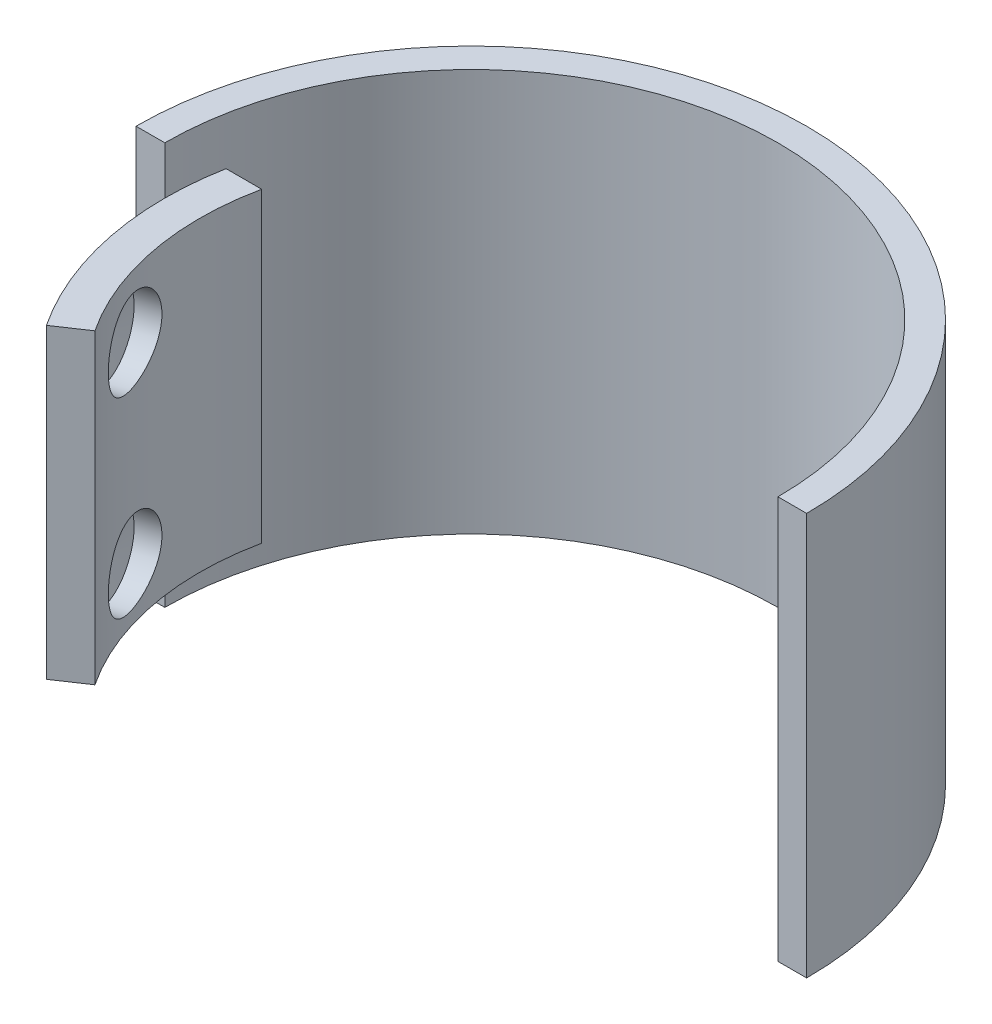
ISO-10303-21;
HEADER;
FILE_DESCRIPTION(('STEP AP214'),'2;1');
FILE_NAME('part.step','',(''),(''),'','','');
FILE_SCHEMA(('AUTOMOTIVE_DESIGN { 1 0 10303 214 1 1 1 1 }'));
ENDSEC;
DATA;
#1=APPLICATION_CONTEXT('core data for automotive mechanical design processes');
#2=APPLICATION_PROTOCOL_DEFINITION('international standard','automotive_design',2000,#1);
#3=PRODUCT_CONTEXT('',#1,'mechanical');
#4=PRODUCT('Part','Part','',(#3));
#5=PRODUCT_RELATED_PRODUCT_CATEGORY('part','',(#4));
#6=PRODUCT_DEFINITION_FORMATION('','',#4);
#7=PRODUCT_DEFINITION_CONTEXT('part definition',#1,'design');
#8=PRODUCT_DEFINITION('design','',#6,#7);
#9=PRODUCT_DEFINITION_SHAPE('','',#8);
#10=(LENGTH_UNIT() NAMED_UNIT(*) SI_UNIT(.MILLI.,.METRE.));
#11=(NAMED_UNIT(*) PLANE_ANGLE_UNIT() SI_UNIT($,.RADIAN.));
#12=(NAMED_UNIT(*) SI_UNIT($,.STERADIAN.) SOLID_ANGLE_UNIT());
#13=UNCERTAINTY_MEASURE_WITH_UNIT(LENGTH_MEASURE(1.E-05),#10,'distance_accuracy_value','');
#14=(GEOMETRIC_REPRESENTATION_CONTEXT(3) GLOBAL_UNCERTAINTY_ASSIGNED_CONTEXT((#13)) GLOBAL_UNIT_ASSIGNED_CONTEXT((#10,
#11,#12)) REPRESENTATION_CONTEXT('',''));
#15=CARTESIAN_POINT('',(0.,0.,0.));
#16=DIRECTION('',(0.,0.,1.));
#17=DIRECTION('',(1.,0.,0.));
#18=AXIS2_PLACEMENT_3D('',#15,#16,#17);
#19=CARTESIAN_POINT('',(0.,42.,0.));
#20=DIRECTION('',(0.,-1.,0.));
#21=DIRECTION('',(0.,0.,-1.));
#22=AXIS2_PLACEMENT_3D('',#19,#20,#21);
#23=CYLINDRICAL_SURFACE('',#22,28.3557302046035);
#24=CARTESIAN_POINT('',(-27.0775799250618,26.3940727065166,8.41736899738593));
#25=CARTESIAN_POINT('',(-27.007134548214,26.3940824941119,8.64396979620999));
#26=CARTESIAN_POINT('',(-26.9337812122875,26.4140140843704,8.86981087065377));
#27=CARTESIAN_POINT('',(-26.7836104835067,26.4931937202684,9.31346637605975));
#28=CARTESIAN_POINT('',(-26.7067897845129,26.552480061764,9.53127277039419));
#29=CARTESIAN_POINT('',(-26.5526498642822,26.7085580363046,9.95261365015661));
#30=CARTESIAN_POINT('',(-26.4753310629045,26.8053213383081,10.1561587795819));
#31=CARTESIAN_POINT('',(-26.3233539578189,27.0335372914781,10.5438074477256));
#32=CARTESIAN_POINT('',(-26.2486952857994,27.1649851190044,10.727913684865));
#33=CARTESIAN_POINT('',(-26.1048669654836,27.4599313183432,11.0733308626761));
#34=CARTESIAN_POINT('',(-26.0357392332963,27.6236468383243,11.234473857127));
#35=CARTESIAN_POINT('',(-25.9069147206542,27.978013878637,11.5284442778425));
#36=CARTESIAN_POINT('',(-25.8472184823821,28.1686669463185,11.6612700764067));
#37=CARTESIAN_POINT('',(-25.740084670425,28.5726580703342,11.8958922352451));
#38=CARTESIAN_POINT('',(-25.6927088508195,28.7861031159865,11.9975327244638));
#39=CARTESIAN_POINT('',(-25.6132266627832,29.22889122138,12.1662981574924));
#40=CARTESIAN_POINT('',(-25.5811194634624,29.4582334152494,12.2334249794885));
#41=CARTESIAN_POINT('',(-25.5342069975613,29.9244882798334,12.3310441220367));
#42=CARTESIAN_POINT('',(-25.5192741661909,30.1613315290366,12.3618065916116));
#43=CARTESIAN_POINT('',(-25.5071570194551,30.6373808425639,12.3867905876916));
#44=CARTESIAN_POINT('',(-25.5099716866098,30.8765867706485,12.3810142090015));
#45=CARTESIAN_POINT('',(-25.5330829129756,31.3484815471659,12.3332796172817));
#46=CARTESIAN_POINT('',(-25.5532345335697,31.5812079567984,12.2916213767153));
#47=CARTESIAN_POINT('',(-25.6096673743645,32.0356412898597,12.1736031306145));
#48=CARTESIAN_POINT('',(-25.6459490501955,32.2573479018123,12.0972421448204));
#49=CARTESIAN_POINT('',(-25.7328017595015,32.6844507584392,11.9113751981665));
#50=CARTESIAN_POINT('',(-25.7834283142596,32.8897795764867,11.8017403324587));
#51=CARTESIAN_POINT('',(-25.8962222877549,33.2775582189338,11.5521341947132));
#52=CARTESIAN_POINT('',(-25.9583904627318,33.4600065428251,11.4121609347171));
#53=CARTESIAN_POINT('',(-26.0918141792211,33.7987546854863,11.1037432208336));
#54=CARTESIAN_POINT('',(-26.1631542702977,33.9547751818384,10.9350284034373));
#55=CARTESIAN_POINT('',(-26.3110001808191,34.2340517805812,10.5743383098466));
#56=CARTESIAN_POINT('',(-26.3875060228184,34.3573077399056,10.3823629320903));
#57=CARTESIAN_POINT('',(-26.542306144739,34.567570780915,9.97997302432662));
#58=CARTESIAN_POINT('',(-26.6206014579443,34.654556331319,9.76954763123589));
#59=CARTESIAN_POINT('',(-26.7757132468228,34.7895666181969,9.33603578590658));
#60=CARTESIAN_POINT('',(-26.8525298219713,34.8375939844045,9.11295018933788));
#61=CARTESIAN_POINT('',(-27.0011698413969,34.8929532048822,8.66256048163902));
#62=CARTESIAN_POINT('',(-27.0730339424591,34.9006690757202,8.43531695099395));
#63=CARTESIAN_POINT('',(-27.2104090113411,34.8762055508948,7.98106397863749));
#64=CARTESIAN_POINT('',(-27.2759201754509,34.8440273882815,7.7540545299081));
#65=CARTESIAN_POINT('',(-27.3988053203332,34.7410085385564,7.30795511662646));
#66=CARTESIAN_POINT('',(-27.4562169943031,34.6703549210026,7.08883225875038));
#67=CARTESIAN_POINT('',(-27.5624862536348,34.492588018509,6.66369604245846));
#68=CARTESIAN_POINT('',(-27.6113434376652,34.3854730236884,6.45768329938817));
#69=CARTESIAN_POINT('',(-27.7006290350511,34.1369228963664,6.06331689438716));
#70=CARTESIAN_POINT('',(-27.7409936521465,33.9952441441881,5.87510235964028));
#71=CARTESIAN_POINT('',(-27.8131173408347,33.6819274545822,5.52360342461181));
#72=CARTESIAN_POINT('',(-27.8448759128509,33.5102877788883,5.36032047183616));
#73=CARTESIAN_POINT('',(-27.9005896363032,33.1402119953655,5.06238623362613));
#74=CARTESIAN_POINT('',(-27.9244778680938,32.941565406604,4.92798370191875));
#75=CARTESIAN_POINT('',(-27.9647939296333,32.5241164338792,4.69381653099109));
#76=CARTESIAN_POINT('',(-27.9812219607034,32.305314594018,4.59405095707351));
#77=CARTESIAN_POINT('',(-28.0072298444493,31.8545339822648,4.43274282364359));
#78=CARTESIAN_POINT('',(-28.0168337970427,31.6226047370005,4.37106585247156));
#79=CARTESIAN_POINT('',(-28.0297463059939,31.1515206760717,4.28749064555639));
#80=CARTESIAN_POINT('',(-28.0330552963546,30.9123663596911,4.26558966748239));
#81=CARTESIAN_POINT('',(-28.0335495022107,30.4361865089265,4.26233905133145));
#82=CARTESIAN_POINT('',(-28.0307958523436,30.1991637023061,4.28058458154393));
#83=CARTESIAN_POINT('',(-28.0191478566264,29.7315971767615,4.35617129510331));
#84=CARTESIAN_POINT('',(-28.0102535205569,29.5010534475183,4.41351241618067));
#85=CARTESIAN_POINT('',(-27.9859120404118,29.0531012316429,4.56530623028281));
#86=CARTESIAN_POINT('',(-27.9704698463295,28.835682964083,4.65973088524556));
#87=CARTESIAN_POINT('',(-27.9324179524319,28.4197640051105,4.88264185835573));
#88=CARTESIAN_POINT('',(-27.9098080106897,28.2212639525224,5.01112932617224));
#89=CARTESIAN_POINT('',(-27.8564834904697,27.8467597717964,5.29956777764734));
#90=CARTESIAN_POINT('',(-27.8256931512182,27.6709900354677,5.45980912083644));
#91=CARTESIAN_POINT('',(-27.7554973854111,27.3490130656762,5.80611295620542));
#92=CARTESIAN_POINT('',(-27.7160899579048,27.2028127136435,5.99218144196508));
#93=CARTESIAN_POINT('',(-27.6281039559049,26.9434071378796,6.38561895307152));
#94=CARTESIAN_POINT('',(-27.5794761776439,26.8303876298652,6.59309940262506));
#95=CARTESIAN_POINT('',(-27.473357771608,26.6418239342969,7.02215734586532));
#96=CARTESIAN_POINT('',(-27.4158764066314,26.5662409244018,7.24371996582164));
#97=CARTESIAN_POINT('',(-27.3117971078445,26.4718470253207,7.62492261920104));
#98=CARTESIAN_POINT('',(-27.2672861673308,26.4427262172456,7.78265849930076));
#99=CARTESIAN_POINT('',(-27.1748524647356,26.4038357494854,8.09951021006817));
#100=CARTESIAN_POINT('',(-27.1269297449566,26.3940658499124,8.25862602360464));
#101=CARTESIAN_POINT('',(-27.0775799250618,26.3940727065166,8.41736899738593));
#102=B_SPLINE_CURVE_WITH_KNOTS('',3,(#24,#25,#26,#27,#28,#29,#30,#31,#32,#33,#34,#35,#36,#37,
#38,#39,#40,#41,#42,#43,#44,#45,#46,#47,#48,#49,#50,#51,#52,#53,#54,#55,#56,#57,#58,#59,#60,#61,
#62,#63,#64,#65,#66,#67,#68,#69,#70,#71,#72,#73,#74,#75,#76,#77,#78,#79,#80,#81,#82,#83,#84,#85,
#86,#87,#88,#89,#90,#91,#92,#93,#94,#95,#96,#97,#98,#99,#100,#101),.UNSPECIFIED.,.T.,.F.,(4,2,2,
2,2,2,2,2,2,2,2,2,2,2,2,2,2,2,2,2,2,2,2,2,2,2,2,2,2,2,2,2,2,2,2,2,2,2,4),(0.,0.711287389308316,
1.42326794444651,2.13471131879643,2.84605580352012,3.56236169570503,4.2787087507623,
4.99858003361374,5.71841213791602,6.43286234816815,7.14727159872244,7.85576572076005,
8.56427985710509,9.27557463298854,9.98691603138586,10.7053611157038,11.423809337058,
12.1426834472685,12.8615090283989,13.5734742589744,14.2854174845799,14.9939297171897,
15.702475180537,16.4161668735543,17.1298999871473,17.8495539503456,18.5691884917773,
19.2862687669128,20.0032996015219,20.7131331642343,21.4229655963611,22.1322623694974,
22.8415830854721,23.5577169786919,24.2740173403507,24.9942536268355,25.7137414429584,
26.2120330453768,26.7103184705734),.UNSPECIFIED.);
#103=CARTESIAN_POINT('',(-27.0775799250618,26.3940727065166,8.41736899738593));
#104=VERTEX_POINT('',#103);
#105=EDGE_CURVE('E234',#104,#104,#102,.T.);
#106=ORIENTED_EDGE('',*,*,#105,.T.);
#107=EDGE_LOOP('',(#106));
#108=FACE_BOUND('',#107,.T.);
#109=CARTESIAN_POINT('',(-27.0775799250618,6.39407270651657,8.41736899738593));
#110=CARTESIAN_POINT('',(-27.007134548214,6.39408249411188,8.64396979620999));
#111=CARTESIAN_POINT('',(-26.9337812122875,6.41401408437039,8.86981087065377));
#112=CARTESIAN_POINT('',(-26.7836104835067,6.4931937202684,9.31346637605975));
#113=CARTESIAN_POINT('',(-26.7067897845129,6.552480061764,9.53127277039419));
#114=CARTESIAN_POINT('',(-26.5526498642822,6.70855803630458,9.95261365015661));
#115=CARTESIAN_POINT('',(-26.4753310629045,6.8053213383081,10.1561587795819));
#116=CARTESIAN_POINT('',(-26.3233539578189,7.03353729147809,10.5438074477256));
#117=CARTESIAN_POINT('',(-26.2486952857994,7.16498511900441,10.7279136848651));
#118=CARTESIAN_POINT('',(-26.1048669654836,7.45993131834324,11.0733308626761));
#119=CARTESIAN_POINT('',(-26.0357392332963,7.62364683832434,11.234473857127));
#120=CARTESIAN_POINT('',(-25.9069147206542,7.97801387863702,11.5284442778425));
#121=CARTESIAN_POINT('',(-25.8472184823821,8.16866694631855,11.6612700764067));
#122=CARTESIAN_POINT('',(-25.740084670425,8.5726580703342,11.8958922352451));
#123=CARTESIAN_POINT('',(-25.6927088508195,8.78610311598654,11.9975327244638));
#124=CARTESIAN_POINT('',(-25.6132266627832,9.22889122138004,12.1662981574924));
#125=CARTESIAN_POINT('',(-25.5811194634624,9.45823341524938,12.2334249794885));
#126=CARTESIAN_POINT('',(-25.5342069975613,9.92448827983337,12.3310441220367));
#127=CARTESIAN_POINT('',(-25.5192741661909,10.1613315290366,12.3618065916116));
#128=CARTESIAN_POINT('',(-25.5071570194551,10.6373808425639,12.3867905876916));
#129=CARTESIAN_POINT('',(-25.5099716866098,10.8765867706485,12.3810142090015));
#130=CARTESIAN_POINT('',(-25.5330829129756,11.3484815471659,12.3332796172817));
#131=CARTESIAN_POINT('',(-25.5532345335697,11.5812079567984,12.2916213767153));
#132=CARTESIAN_POINT('',(-25.6096673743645,12.0356412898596,12.1736031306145));
#133=CARTESIAN_POINT('',(-25.6459490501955,12.2573479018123,12.0972421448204));
#134=CARTESIAN_POINT('',(-25.7328017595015,12.6844507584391,11.9113751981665));
#135=CARTESIAN_POINT('',(-25.7834283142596,12.8897795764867,11.8017403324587));
#136=CARTESIAN_POINT('',(-25.8962222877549,13.2775582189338,11.5521341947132));
#137=CARTESIAN_POINT('',(-25.9583904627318,13.4600065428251,11.4121609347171));
#138=CARTESIAN_POINT('',(-26.0918141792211,13.7987546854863,11.1037432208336));
#139=CARTESIAN_POINT('',(-26.1631542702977,13.9547751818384,10.9350284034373));
#140=CARTESIAN_POINT('',(-26.3110001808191,14.2340517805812,10.5743383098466));
#141=CARTESIAN_POINT('',(-26.3875060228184,14.3573077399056,10.3823629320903));
#142=CARTESIAN_POINT('',(-26.542306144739,14.567570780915,9.97997302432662));
#143=CARTESIAN_POINT('',(-26.6206014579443,14.654556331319,9.76954763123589));
#144=CARTESIAN_POINT('',(-26.7757132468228,14.7895666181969,9.33603578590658));
#145=CARTESIAN_POINT('',(-26.8525298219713,14.8375939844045,9.11295018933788));
#146=CARTESIAN_POINT('',(-27.0011698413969,14.8929532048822,8.66256048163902));
#147=CARTESIAN_POINT('',(-27.0730339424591,14.9006690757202,8.43531695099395));
#148=CARTESIAN_POINT('',(-27.2104090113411,14.8762055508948,7.98106397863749));
#149=CARTESIAN_POINT('',(-27.2759201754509,14.8440273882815,7.7540545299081));
#150=CARTESIAN_POINT('',(-27.3988053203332,14.7410085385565,7.30795511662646));
#151=CARTESIAN_POINT('',(-27.4562169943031,14.6703549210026,7.08883225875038));
#152=CARTESIAN_POINT('',(-27.5624862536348,14.492588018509,6.66369604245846));
#153=CARTESIAN_POINT('',(-27.6113434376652,14.3854730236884,6.45768329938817));
#154=CARTESIAN_POINT('',(-27.7006290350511,14.1369228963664,6.06331689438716));
#155=CARTESIAN_POINT('',(-27.7409936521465,13.9952441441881,5.87510235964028));
#156=CARTESIAN_POINT('',(-27.8131173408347,13.6819274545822,5.52360342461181));
#157=CARTESIAN_POINT('',(-27.8448759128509,13.5102877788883,5.36032047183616));
#158=CARTESIAN_POINT('',(-27.9005896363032,13.1402119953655,5.06238623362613));
#159=CARTESIAN_POINT('',(-27.9244778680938,12.941565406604,4.92798370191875));
#160=CARTESIAN_POINT('',(-27.9647939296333,12.5241164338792,4.69381653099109));
#161=CARTESIAN_POINT('',(-27.9812219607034,12.305314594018,4.59405095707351));
#162=CARTESIAN_POINT('',(-28.0072298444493,11.8545339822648,4.43274282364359));
#163=CARTESIAN_POINT('',(-28.0168337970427,11.6226047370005,4.37106585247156));
#164=CARTESIAN_POINT('',(-28.0297463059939,11.1515206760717,4.28749064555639));
#165=CARTESIAN_POINT('',(-28.0330552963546,10.9123663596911,4.26558966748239));
#166=CARTESIAN_POINT('',(-28.0335495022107,10.4361865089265,4.26233905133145));
#167=CARTESIAN_POINT('',(-28.0307958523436,10.1991637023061,4.28058458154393));
#168=CARTESIAN_POINT('',(-28.0191478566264,9.73159717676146,4.35617129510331));
#169=CARTESIAN_POINT('',(-28.0102535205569,9.50105344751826,4.41351241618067));
#170=CARTESIAN_POINT('',(-27.9859120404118,9.05310123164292,4.56530623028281));
#171=CARTESIAN_POINT('',(-27.9704698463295,8.83568296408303,4.65973088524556));
#172=CARTESIAN_POINT('',(-27.9324179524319,8.41976400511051,4.88264185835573));
#173=CARTESIAN_POINT('',(-27.9098080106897,8.22126395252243,5.01112932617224));
#174=CARTESIAN_POINT('',(-27.8564834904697,7.84675977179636,5.29956777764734));
#175=CARTESIAN_POINT('',(-27.8256931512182,7.6709900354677,5.45980912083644));
#176=CARTESIAN_POINT('',(-27.7554973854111,7.34901306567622,5.80611295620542));
#177=CARTESIAN_POINT('',(-27.7160899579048,7.20281271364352,5.99218144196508));
#178=CARTESIAN_POINT('',(-27.6281039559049,6.94340713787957,6.38561895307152));
#179=CARTESIAN_POINT('',(-27.5794761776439,6.83038762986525,6.59309940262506));
#180=CARTESIAN_POINT('',(-27.473357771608,6.64182393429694,7.02215734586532));
#181=CARTESIAN_POINT('',(-27.4158764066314,6.56624092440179,7.24371996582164));
#182=CARTESIAN_POINT('',(-27.3117971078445,6.47184702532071,7.62492261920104));
#183=CARTESIAN_POINT('',(-27.2672861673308,6.44272621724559,7.78265849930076));
#184=CARTESIAN_POINT('',(-27.1748524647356,6.40383574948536,8.09951021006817));
#185=CARTESIAN_POINT('',(-27.1269297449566,6.39406584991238,8.25862602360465));
#186=CARTESIAN_POINT('',(-27.0775799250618,6.39407270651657,8.41736899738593));
#187=B_SPLINE_CURVE_WITH_KNOTS('',3,(#109,#110,#111,#112,#113,#114,#115,#116,#117,#118,#119,
#120,#121,#122,#123,#124,#125,#126,#127,#128,#129,#130,#131,#132,#133,#134,#135,#136,#137,#138,
#139,#140,#141,#142,#143,#144,#145,#146,#147,#148,#149,#150,#151,#152,#153,#154,#155,#156,#157,
#158,#159,#160,#161,#162,#163,#164,#165,#166,#167,#168,#169,#170,#171,#172,#173,#174,#175,#176,
#177,#178,#179,#180,#181,#182,#183,#184,#185,#186),.UNSPECIFIED.,.T.,.F.,(4,2,2,2,2,2,2,2,2,2,2,
2,2,2,2,2,2,2,2,2,2,2,2,2,2,2,2,2,2,2,2,2,2,2,2,2,2,2,4),(0.,0.711287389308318,1.42326794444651,
2.13471131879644,2.84605580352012,3.56236169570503,4.2787087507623,4.99858003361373,
5.71841213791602,6.43286234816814,7.14727159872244,7.85576572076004,8.56427985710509,
9.27557463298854,9.98691603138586,10.7053611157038,11.423809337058,12.1426834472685,
12.8615090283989,13.5734742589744,14.2854174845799,14.9939297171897,15.702475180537,
16.4161668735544,17.1298999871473,17.8495539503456,18.5691884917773,19.2862687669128,
20.0032996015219,20.7131331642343,21.4229655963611,22.1322623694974,22.8415830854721,
23.5577169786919,24.2740173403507,24.9942536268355,25.7137414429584,26.2120330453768,
26.7103184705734),.UNSPECIFIED.);
#188=CARTESIAN_POINT('',(-27.0775799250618,6.39407270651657,8.41736899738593));
#189=VERTEX_POINT('',#188);
#190=EDGE_CURVE('E227',#189,#189,#187,.T.);
#191=ORIENTED_EDGE('',*,*,#190,.T.);
#192=EDGE_LOOP('',(#191));
#193=FACE_BOUND('',#192,.T.);
#194=DIRECTION('',(0.,-1.,0.));
#195=VECTOR('',#194,1.);
#196=CARTESIAN_POINT('',(-23.6488843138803,42.,15.6453733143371));
#197=LINE('',#196,#195);
#198=CARTESIAN_POINT('',(-23.6488843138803,37.,15.6453733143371));
#199=VERTEX_POINT('',#198);
#200=CARTESIAN_POINT('',(-23.6488843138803,5.,15.6453733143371));
#201=VERTEX_POINT('',#200);
#202=EDGE_CURVE('E210',#199,#201,#197,.T.);
#203=ORIENTED_EDGE('',*,*,#202,.T.);
#204=CARTESIAN_POINT('',(0.,5.,0.));
#205=DIRECTION('',(0.,1.,0.));
#206=DIRECTION('',(0.,0.,1.));
#207=AXIS2_PLACEMENT_3D('',#204,#205,#206);
#208=CIRCLE('',#207,28.3557302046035);
#209=CARTESIAN_POINT('',(-27.7439136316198,5.,-5.85855714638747));
#210=VERTEX_POINT('',#209);
#211=EDGE_CURVE('E274',#201,#210,#208,.F.);
#212=ORIENTED_EDGE('',*,*,#211,.T.);
#213=DIRECTION('',(0.,-1.,0.));
#214=VECTOR('',#213,1.);
#215=CARTESIAN_POINT('',(-27.7439136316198,42.,-5.85855714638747));
#216=LINE('',#215,#214);
#217=CARTESIAN_POINT('',(-27.7439136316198,37.,-5.85855714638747));
#218=VERTEX_POINT('',#217);
#219=EDGE_CURVE('E206',#218,#210,#216,.T.);
#220=ORIENTED_EDGE('',*,*,#219,.F.);
#221=CARTESIAN_POINT('',(0.,37.,0.));
#222=DIRECTION('',(0.,1.,0.));
#223=DIRECTION('',(0.,0.,1.));
#224=AXIS2_PLACEMENT_3D('',#221,#222,#223);
#225=CIRCLE('',#224,28.3557302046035);
#226=EDGE_CURVE('E266',#199,#218,#225,.F.);
#227=ORIENTED_EDGE('',*,*,#226,.F.);
#228=EDGE_LOOP('',(#203,#212,#220,#227));
#229=FACE_BOUND('',#228,.T.);
#230=ADVANCED_FACE('F33',(#108,#193,#229),#23,.F.);
#231=CARTESIAN_POINT('',(0.,42.,0.));
#232=DIRECTION('',(0.,-1.,0.));
#233=DIRECTION('',(0.,0.,-1.));
#234=AXIS2_PLACEMENT_3D('',#231,#232,#233);
#235=CYLINDRICAL_SURFACE('',#234,32.);
#236=DIRECTION('',(0.,-1.,0.));
#237=VECTOR('',#236,1.);
#238=CARTESIAN_POINT('',(-32.,42.,0.));
#239=LINE('',#238,#237);
#240=CARTESIAN_POINT('',(-32.,37.,0.));
#241=VERTEX_POINT('',#240);
#242=CARTESIAN_POINT('',(-32.,5.,0.));
#243=VERTEX_POINT('',#242);
#244=EDGE_CURVE('E216',#241,#243,#239,.T.);
#245=ORIENTED_EDGE('',*,*,#244,.T.);
#246=CARTESIAN_POINT('',(0.,5.,0.));
#247=DIRECTION('',(0.,-1.,0.));
#248=DIRECTION('',(0.,0.,1.));
#249=AXIS2_PLACEMENT_3D('',#246,#247,#248);
#250=CIRCLE('',#249,32.);
#251=CARTESIAN_POINT('',(-26.6744710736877,5.,17.676894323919));
#252=VERTEX_POINT('',#251);
#253=EDGE_CURVE('E282',#252,#243,#250,.T.);
#254=ORIENTED_EDGE('',*,*,#253,.F.);
#255=DIRECTION('',(0.,-1.,0.));
#256=VECTOR('',#255,1.);
#257=CARTESIAN_POINT('',(-26.6744710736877,42.,17.676894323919));
#258=LINE('',#257,#256);
#259=CARTESIAN_POINT('',(-26.6744710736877,37.,17.676894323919));
#260=VERTEX_POINT('',#259);
#261=EDGE_CURVE('E213',#260,#252,#258,.T.);
#262=ORIENTED_EDGE('',*,*,#261,.F.);
#263=CARTESIAN_POINT('',(0.,37.,0.));
#264=DIRECTION('',(0.,1.,0.));
#265=DIRECTION('',(0.,0.,1.));
#266=AXIS2_PLACEMENT_3D('',#263,#264,#265);
#267=CIRCLE('',#266,32.);
#268=EDGE_CURVE('E269',#241,#260,#267,.T.);
#269=ORIENTED_EDGE('',*,*,#268,.F.);
#270=EDGE_LOOP('',(#245,#254,#262,#269));
#271=FACE_BOUND('',#270,.T.);
#272=ADVANCED_FACE('F155',(#271),#235,.T.);
#273=CARTESIAN_POINT('',(-23.6488843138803,42.,15.6453733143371));
#274=DIRECTION('',(-0.557444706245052,0.,-0.830214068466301));
#275=DIRECTION('',(-0.830214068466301,0.,0.557444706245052));
#276=AXIS2_PLACEMENT_3D('',#273,#274,#275);
#277=PLANE('',#276);
#278=ORIENTED_EDGE('',*,*,#261,.T.);
#279=DIRECTION('',(0.830214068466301,0.,-0.557444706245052));
#280=VECTOR('',#279,1.);
#281=CARTESIAN_POINT('',(-23.6488843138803,5.,15.6453733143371));
#282=LINE('',#281,#280);
#283=EDGE_CURVE('E271',#252,#201,#282,.T.);
#284=ORIENTED_EDGE('',*,*,#283,.T.);
#285=ORIENTED_EDGE('',*,*,#202,.F.);
#286=DIRECTION('',(0.830214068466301,0.,-0.557444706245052));
#287=VECTOR('',#286,1.);
#288=CARTESIAN_POINT('',(-23.6488843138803,37.,15.6453733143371));
#289=LINE('',#288,#287);
#290=EDGE_CURVE('E264',#260,#199,#289,.T.);
#291=ORIENTED_EDGE('',*,*,#290,.F.);
#292=EDGE_LOOP('',(#278,#284,#285,#291));
#293=FACE_BOUND('',#292,.T.);
#294=ADVANCED_FACE('F161',(#293),#277,.F.);
#295=CARTESIAN_POINT('',(-27.7439136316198,42.,-5.85855714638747));
#296=DIRECTION('',(0.,0.,1.));
#297=DIRECTION('',(1.,0.,0.));
#298=AXIS2_PLACEMENT_3D('',#295,#296,#297);
#299=PLANE('',#298);
#300=ORIENTED_EDGE('',*,*,#219,.T.);
#301=DIRECTION('',(-1.,0.,0.));
#302=VECTOR('',#301,1.);
#303=CARTESIAN_POINT('',(-27.7439136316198,5.,-5.85855714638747));
#304=LINE('',#303,#302);
#305=CARTESIAN_POINT('',(-31.4591371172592,5.,-5.85855714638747));
#306=VERTEX_POINT('',#305);
#307=EDGE_CURVE('E277',#210,#306,#304,.T.);
#308=ORIENTED_EDGE('',*,*,#307,.T.);
#309=DIRECTION('',(0.,-1.,0.));
#310=VECTOR('',#309,1.);
#311=CARTESIAN_POINT('',(-31.4591371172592,42.,-5.85855714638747));
#312=LINE('',#311,#310);
#313=CARTESIAN_POINT('',(-31.4591371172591,37.,-5.85855714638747));
#314=VERTEX_POINT('',#313);
#315=EDGE_CURVE('E203',#314,#306,#312,.T.);
#316=ORIENTED_EDGE('',*,*,#315,.F.);
#317=DIRECTION('',(-1.,0.,0.));
#318=VECTOR('',#317,1.);
#319=CARTESIAN_POINT('',(-27.7439136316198,37.,-5.85855714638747));
#320=LINE('',#319,#318);
#321=EDGE_CURVE('E11',#218,#314,#320,.T.);
#322=ORIENTED_EDGE('',*,*,#321,.F.);
#323=EDGE_LOOP('',(#300,#308,#316,#322));
#324=FACE_BOUND('',#323,.T.);
#325=ADVANCED_FACE('F168',(#324),#299,.F.);
#326=CARTESIAN_POINT('',(0.,42.,0.));
#327=DIRECTION('',(0.,-1.,0.));
#328=DIRECTION('',(0.,0.,-1.));
#329=AXIS2_PLACEMENT_3D('',#326,#327,#328);
#330=CYLINDRICAL_SURFACE('',#329,32.);
#331=CARTESIAN_POINT('',(30.4375,26.1919257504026,-9.87717539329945));
#332=CARTESIAN_POINT('',(30.364157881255,26.1919357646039,-10.1031751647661));
#333=CARTESIAN_POINT('',(30.2882338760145,26.2119182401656,-10.3284899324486));
#334=CARTESIAN_POINT('',(30.1336217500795,26.291311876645,-10.7712580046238));
#335=CARTESIAN_POINT('',(30.0549308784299,26.3507633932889,-10.9887030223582));
#336=CARTESIAN_POINT('',(29.8977287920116,26.5073051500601,-11.409479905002));
#337=CARTESIAN_POINT('',(29.8192174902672,26.6043691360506,-11.6128214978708));
#338=CARTESIAN_POINT('',(29.6654651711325,26.8333210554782,-12.0001522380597));
#339=CARTESIAN_POINT('',(29.5902236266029,26.9652033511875,-12.184144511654));
#340=CARTESIAN_POINT('',(29.4458274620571,27.2609191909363,-12.5291044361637));
#341=CARTESIAN_POINT('',(29.3767087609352,27.4249252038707,-12.6899392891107));
#342=CARTESIAN_POINT('',(29.2482289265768,27.7798622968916,-12.9833285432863));
#343=CARTESIAN_POINT('',(29.1888683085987,27.9707947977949,-13.1158814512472));
#344=CARTESIAN_POINT('',(29.0826206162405,28.3750673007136,-13.3498242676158));
#345=CARTESIAN_POINT('',(29.0357820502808,28.5884901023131,-13.4510932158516));
#346=CARTESIAN_POINT('',(28.9573237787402,29.0311174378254,-13.6191797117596));
#347=CARTESIAN_POINT('',(28.9257034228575,29.2603212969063,-13.6859987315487));
#348=CARTESIAN_POINT('',(28.8795342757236,29.7265722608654,-13.7831565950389));
#349=CARTESIAN_POINT('',(28.8648859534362,29.9635651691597,-13.8137081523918));
#350=CARTESIAN_POINT('',(28.8531331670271,30.4398621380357,-13.8382405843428));
#351=CARTESIAN_POINT('',(28.8560279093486,30.6791660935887,-13.832223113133));
#352=CARTESIAN_POINT('',(28.8791227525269,31.1516615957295,-13.7839384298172));
#353=CARTESIAN_POINT('',(28.8992109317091,31.3848826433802,-13.7419056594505));
#354=CARTESIAN_POINT('',(28.9554559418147,31.8402355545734,-13.6229901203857));
#355=CARTESIAN_POINT('',(28.9916131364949,32.0623671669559,-13.5461065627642));
#356=CARTESIAN_POINT('',(29.0782362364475,32.4900309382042,-13.3591455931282));
#357=CARTESIAN_POINT('',(29.1287462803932,32.6955093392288,-13.2489657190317));
#358=CARTESIAN_POINT('',(29.2414840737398,33.083444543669,-12.9982476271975));
#359=CARTESIAN_POINT('',(29.3037124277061,33.2659001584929,-12.8577078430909));
#360=CARTESIAN_POINT('',(29.437436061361,33.6041047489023,-12.5485408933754));
#361=CARTESIAN_POINT('',(29.5089999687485,33.7596338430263,-12.3797027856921));
#362=CARTESIAN_POINT('',(29.6577392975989,34.0378556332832,-12.0190054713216));
#363=CARTESIAN_POINT('',(29.7349147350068,34.1605482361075,-11.8271461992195));
#364=CARTESIAN_POINT('',(29.8916131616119,34.3696176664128,-11.4253197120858));
#365=CARTESIAN_POINT('',(29.9711370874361,34.4559797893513,-11.2153452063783));
#366=CARTESIAN_POINT('',(30.1293684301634,34.5897573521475,-10.7830464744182));
#367=CARTESIAN_POINT('',(30.2080758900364,34.6371748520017,-10.5607229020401));
#368=CARTESIAN_POINT('',(30.3613230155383,34.6914300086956,-10.1116722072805));
#369=CARTESIAN_POINT('',(30.4358895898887,34.6985703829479,-9.88499081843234));
#370=CARTESIAN_POINT('',(30.5792776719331,34.672868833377,-9.43208359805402));
#371=CARTESIAN_POINT('',(30.6480993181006,34.6400278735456,-9.20585775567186));
#372=CARTESIAN_POINT('',(30.7781382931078,34.5355474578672,-8.76126036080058));
#373=CARTESIAN_POINT('',(30.8393830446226,34.4640532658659,-8.54286264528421));
#374=CARTESIAN_POINT('',(30.9535798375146,34.2844475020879,-8.11936224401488));
#375=CARTESIAN_POINT('',(31.0065315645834,34.1763345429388,-7.91426006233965));
#376=CARTESIAN_POINT('',(31.1039820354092,33.9258343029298,-7.52219362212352));
#377=CARTESIAN_POINT('',(31.148430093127,33.7832523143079,-7.33534118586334));
#378=CARTESIAN_POINT('',(31.2284886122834,33.4681355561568,-6.98667029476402));
#379=CARTESIAN_POINT('',(31.2640986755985,33.2955994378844,-6.82485296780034));
#380=CARTESIAN_POINT('',(31.3269761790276,32.9241343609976,-6.53019665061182));
#381=CARTESIAN_POINT('',(31.3541883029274,32.7250422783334,-6.39755139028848));
#382=CARTESIAN_POINT('',(31.400397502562,32.3069038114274,-6.16676158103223));
#383=CARTESIAN_POINT('',(31.4193947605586,32.0878578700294,-6.06861626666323));
#384=CARTESIAN_POINT('',(31.449569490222,31.6366647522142,-5.91025403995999));
#385=CARTESIAN_POINT('',(31.4607695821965,31.4045576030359,-5.84992746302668));
#386=CARTESIAN_POINT('',(31.4757523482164,30.9333085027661,-5.76877330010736));
#387=CARTESIAN_POINT('',(31.4795354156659,30.6941669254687,-5.74794361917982));
#388=CARTESIAN_POINT('',(31.4798003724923,30.2176414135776,-5.74649143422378));
#389=CARTESIAN_POINT('',(31.4763393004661,29.9802584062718,-5.76555482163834));
#390=CARTESIAN_POINT('',(31.4621263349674,29.5121265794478,-5.84261228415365));
#391=CARTESIAN_POINT('',(31.4513744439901,29.2813777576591,-5.90060634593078));
#392=CARTESIAN_POINT('',(31.42228852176,28.8331196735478,-6.05357724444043));
#393=CARTESIAN_POINT('',(31.4039579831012,28.6156043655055,-6.1485370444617));
#394=CARTESIAN_POINT('',(31.3592954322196,28.1997149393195,-6.37240624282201));
#395=CARTESIAN_POINT('',(31.3329632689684,28.0013411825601,-6.50131628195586));
#396=CARTESIAN_POINT('',(31.2716348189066,27.6277513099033,-6.79019599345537));
#397=CARTESIAN_POINT('',(31.2365747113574,27.4527210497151,-6.95039249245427));
#398=CARTESIAN_POINT('',(31.1575705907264,27.1324123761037,-7.29638370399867));
#399=CARTESIAN_POINT('',(31.1136244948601,26.9871409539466,-7.48218441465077));
#400=CARTESIAN_POINT('',(31.0166286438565,26.7299343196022,-7.8746266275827));
#401=CARTESIAN_POINT('',(30.9635406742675,26.618144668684,-8.08135404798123));
#402=CARTESIAN_POINT('',(30.8488456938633,26.4320880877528,-8.50866981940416));
#403=CARTESIAN_POINT('',(30.7872479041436,26.3577809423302,-8.72924302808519));
#404=CARTESIAN_POINT('',(30.6776349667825,26.2663150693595,-9.10537778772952));
#405=CARTESIAN_POINT('',(30.6316304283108,26.2384598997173,-9.25901051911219));
#406=CARTESIAN_POINT('',(30.5366534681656,26.2012618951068,-9.56759419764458));
#407=CARTESIAN_POINT('',(30.4876810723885,26.1919188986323,-9.72254513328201));
#408=CARTESIAN_POINT('',(30.4375,26.1919257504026,-9.87717539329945));
#409=B_SPLINE_CURVE_WITH_KNOTS('',3,(#331,#332,#333,#334,#335,#336,#337,#338,#339,#340,#341,
#342,#343,#344,#345,#346,#347,#348,#349,#350,#351,#352,#353,#354,#355,#356,#357,#358,#359,#360,
#361,#362,#363,#364,#365,#366,#367,#368,#369,#370,#371,#372,#373,#374,#375,#376,#377,#378,#379,
#380,#381,#382,#383,#384,#385,#386,#387,#388,#389,#390,#391,#392,#393,#394,#395,#396,#397,#398,
#399,#400,#401,#402,#403,#404,#405,#406,#407,#408),.UNSPECIFIED.,.T.,.F.,(4,2,2,2,2,2,2,2,2,2,2,
2,2,2,2,2,2,2,2,2,2,2,2,2,2,2,2,2,2,2,2,2,2,2,2,2,2,2,4),(0.,0.712213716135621,1.42515676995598,
2.13760307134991,2.84993408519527,3.56619988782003,4.28250349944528,5.0015430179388,
5.72055180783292,6.43532234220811,7.15006054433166,7.86018119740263,8.57031792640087,
9.28266259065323,9.99504401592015,10.7129933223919,11.4309446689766,12.1491863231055,
12.8673899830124,13.580188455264,14.2929697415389,15.0030907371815,15.7132386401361,
16.4274958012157,17.141785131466,17.8606836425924,18.5795662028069,19.2963544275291,
20.0131046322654,20.7242325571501,21.4353602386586,22.1461605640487,22.8569743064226,
23.5731467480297,24.2894872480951,25.008898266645,25.7275357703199,26.2148404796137,
26.7021409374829),.UNSPECIFIED.);
#410=CARTESIAN_POINT('',(30.4375,26.1919257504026,-9.87717539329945));
#411=VERTEX_POINT('',#410);
#412=EDGE_CURVE('E131',#411,#411,#409,.T.);
#413=ORIENTED_EDGE('',*,*,#412,.T.);
#414=EDGE_LOOP('',(#413));
#415=FACE_BOUND('',#414,.T.);
#416=CARTESIAN_POINT('',(30.4375,6.19192575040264,-9.87717539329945));
#417=CARTESIAN_POINT('',(30.364157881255,6.19193576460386,-10.1031751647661));
#418=CARTESIAN_POINT('',(30.2882338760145,6.2119182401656,-10.3284899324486));
#419=CARTESIAN_POINT('',(30.1336217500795,6.291311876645,-10.7712580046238));
#420=CARTESIAN_POINT('',(30.0549308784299,6.35076339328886,-10.9887030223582));
#421=CARTESIAN_POINT('',(29.8977287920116,6.50730515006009,-11.409479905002));
#422=CARTESIAN_POINT('',(29.8192174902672,6.60436913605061,-11.6128214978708));
#423=CARTESIAN_POINT('',(29.6654651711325,6.83332105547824,-12.0001522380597));
#424=CARTESIAN_POINT('',(29.5902236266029,6.96520335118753,-12.184144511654));
#425=CARTESIAN_POINT('',(29.4458274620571,7.26091919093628,-12.5291044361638));
#426=CARTESIAN_POINT('',(29.3767087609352,7.42492520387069,-12.6899392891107));
#427=CARTESIAN_POINT('',(29.2482289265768,7.77986229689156,-12.9833285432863));
#428=CARTESIAN_POINT('',(29.1888683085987,7.9707947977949,-13.1158814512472));
#429=CARTESIAN_POINT('',(29.0826206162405,8.37506730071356,-13.3498242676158));
#430=CARTESIAN_POINT('',(29.0357820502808,8.5884901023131,-13.4510932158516));
#431=CARTESIAN_POINT('',(28.9573237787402,9.03111743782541,-13.6191797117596));
#432=CARTESIAN_POINT('',(28.9257034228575,9.26032129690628,-13.6859987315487));
#433=CARTESIAN_POINT('',(28.8795342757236,9.72657226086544,-13.7831565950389));
#434=CARTESIAN_POINT('',(28.8648859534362,9.96356516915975,-13.8137081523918));
#435=CARTESIAN_POINT('',(28.8531331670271,10.4398621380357,-13.8382405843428));
#436=CARTESIAN_POINT('',(28.8560279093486,10.6791660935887,-13.832223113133));
#437=CARTESIAN_POINT('',(28.8791227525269,11.1516615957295,-13.7839384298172));
#438=CARTESIAN_POINT('',(28.8992109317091,11.3848826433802,-13.7419056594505));
#439=CARTESIAN_POINT('',(28.9554559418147,11.8402355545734,-13.6229901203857));
#440=CARTESIAN_POINT('',(28.9916131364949,12.0623671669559,-13.5461065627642));
#441=CARTESIAN_POINT('',(29.0782362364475,12.4900309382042,-13.3591455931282));
#442=CARTESIAN_POINT('',(29.1287462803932,12.6955093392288,-13.2489657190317));
#443=CARTESIAN_POINT('',(29.2414840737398,13.083444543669,-12.9982476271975));
#444=CARTESIAN_POINT('',(29.3037124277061,13.2659001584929,-12.8577078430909));
#445=CARTESIAN_POINT('',(29.437436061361,13.6041047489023,-12.5485408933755));
#446=CARTESIAN_POINT('',(29.5089999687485,13.7596338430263,-12.3797027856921));
#447=CARTESIAN_POINT('',(29.6577392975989,14.0378556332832,-12.0190054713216));
#448=CARTESIAN_POINT('',(29.7349147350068,14.1605482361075,-11.8271461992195));
#449=CARTESIAN_POINT('',(29.8916131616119,14.3696176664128,-11.4253197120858));
#450=CARTESIAN_POINT('',(29.9711370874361,14.4559797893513,-11.2153452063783));
#451=CARTESIAN_POINT('',(30.1293684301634,14.5897573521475,-10.7830464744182));
#452=CARTESIAN_POINT('',(30.2080758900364,14.6371748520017,-10.5607229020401));
#453=CARTESIAN_POINT('',(30.3613230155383,14.6914300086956,-10.1116722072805));
#454=CARTESIAN_POINT('',(30.4358895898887,14.6985703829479,-9.88499081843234));
#455=CARTESIAN_POINT('',(30.5792776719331,14.672868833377,-9.43208359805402));
#456=CARTESIAN_POINT('',(30.6480993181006,14.6400278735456,-9.20585775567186));
#457=CARTESIAN_POINT('',(30.7781382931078,14.5355474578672,-8.76126036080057));
#458=CARTESIAN_POINT('',(30.8393830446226,14.4640532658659,-8.54286264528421));
#459=CARTESIAN_POINT('',(30.9535798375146,14.2844475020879,-8.11936224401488));
#460=CARTESIAN_POINT('',(31.0065315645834,14.1763345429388,-7.91426006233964));
#461=CARTESIAN_POINT('',(31.1039820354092,13.9258343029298,-7.52219362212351));
#462=CARTESIAN_POINT('',(31.148430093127,13.7832523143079,-7.33534118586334));
#463=CARTESIAN_POINT('',(31.2284886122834,13.4681355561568,-6.98667029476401));
#464=CARTESIAN_POINT('',(31.2640986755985,13.2955994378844,-6.82485296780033));
#465=CARTESIAN_POINT('',(31.3269761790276,12.9241343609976,-6.53019665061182));
#466=CARTESIAN_POINT('',(31.3541883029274,12.7250422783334,-6.39755139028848));
#467=CARTESIAN_POINT('',(31.400397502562,12.3069038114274,-6.16676158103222));
#468=CARTESIAN_POINT('',(31.4193947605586,12.0878578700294,-6.06861626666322));
#469=CARTESIAN_POINT('',(31.449569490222,11.6366647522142,-5.91025403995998));
#470=CARTESIAN_POINT('',(31.4607695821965,11.4045576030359,-5.84992746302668));
#471=CARTESIAN_POINT('',(31.4757523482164,10.9333085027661,-5.76877330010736));
#472=CARTESIAN_POINT('',(31.4795354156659,10.6941669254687,-5.74794361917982));
#473=CARTESIAN_POINT('',(31.4798003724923,10.2176414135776,-5.74649143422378));
#474=CARTESIAN_POINT('',(31.4763393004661,9.98025840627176,-5.76555482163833));
#475=CARTESIAN_POINT('',(31.4621263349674,9.51212657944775,-5.84261228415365));
#476=CARTESIAN_POINT('',(31.4513744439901,9.28137775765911,-5.90060634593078));
#477=CARTESIAN_POINT('',(31.42228852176,8.83311967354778,-6.05357724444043));
#478=CARTESIAN_POINT('',(31.4039579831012,8.6156043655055,-6.1485370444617));
#479=CARTESIAN_POINT('',(31.3592954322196,8.19971493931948,-6.37240624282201));
#480=CARTESIAN_POINT('',(31.3329632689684,8.00134118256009,-6.50131628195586));
#481=CARTESIAN_POINT('',(31.2716348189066,7.62775130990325,-6.79019599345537));
#482=CARTESIAN_POINT('',(31.2365747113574,7.45272104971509,-6.95039249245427));
#483=CARTESIAN_POINT('',(31.1575705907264,7.13241237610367,-7.29638370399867));
#484=CARTESIAN_POINT('',(31.1136244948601,6.98714095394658,-7.48218441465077));
#485=CARTESIAN_POINT('',(31.0166286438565,6.7299343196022,-7.87462662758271));
#486=CARTESIAN_POINT('',(30.9635406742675,6.61814466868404,-8.08135404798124));
#487=CARTESIAN_POINT('',(30.8488456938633,6.43208808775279,-8.50866981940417));
#488=CARTESIAN_POINT('',(30.7872479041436,6.35778094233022,-8.7292430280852));
#489=CARTESIAN_POINT('',(30.6776349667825,6.26631506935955,-9.10537778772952));
#490=CARTESIAN_POINT('',(30.6316304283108,6.23845989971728,-9.2590105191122));
#491=CARTESIAN_POINT('',(30.5366534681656,6.20126189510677,-9.56759419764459));
#492=CARTESIAN_POINT('',(30.4876810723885,6.19191889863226,-9.72254513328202));
#493=CARTESIAN_POINT('',(30.4375,6.19192575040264,-9.87717539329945));
#494=B_SPLINE_CURVE_WITH_KNOTS('',3,(#416,#417,#418,#419,#420,#421,#422,#423,#424,#425,#426,
#427,#428,#429,#430,#431,#432,#433,#434,#435,#436,#437,#438,#439,#440,#441,#442,#443,#444,#445,
#446,#447,#448,#449,#450,#451,#452,#453,#454,#455,#456,#457,#458,#459,#460,#461,#462,#463,#464,
#465,#466,#467,#468,#469,#470,#471,#472,#473,#474,#475,#476,#477,#478,#479,#480,#481,#482,#483,
#484,#485,#486,#487,#488,#489,#490,#491,#492,#493),.UNSPECIFIED.,.T.,.F.,(4,2,2,2,2,2,2,2,2,2,2,
2,2,2,2,2,2,2,2,2,2,2,2,2,2,2,2,2,2,2,2,2,2,2,2,2,2,2,4),(0.,0.712213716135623,1.42515676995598,
2.13760307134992,2.84993408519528,3.56619988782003,4.28250349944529,5.0015430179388,
5.72055180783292,6.43532234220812,7.15006054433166,7.86018119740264,8.57031792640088,
9.28266259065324,9.99504401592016,10.7129933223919,11.4309446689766,12.1491863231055,
12.8673899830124,13.580188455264,14.2929697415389,15.0030907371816,15.7132386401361,
16.4274958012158,17.141785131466,17.8606836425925,18.5795662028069,19.2963544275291,
20.0131046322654,20.7242325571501,21.4353602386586,22.1461605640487,22.8569743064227,
23.5731467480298,24.2894872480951,25.0088982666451,25.7275357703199,26.2148404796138,
26.7021409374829),.UNSPECIFIED.);
#495=CARTESIAN_POINT('',(30.4375,6.19192575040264,-9.87717539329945));
#496=VERTEX_POINT('',#495);
#497=EDGE_CURVE('E284',#496,#496,#494,.T.);
#498=ORIENTED_EDGE('',*,*,#497,.T.);
#499=EDGE_LOOP('',(#498));
#500=FACE_BOUND('',#499,.T.);
#501=CARTESIAN_POINT('',(0.,0.,0.));
#502=DIRECTION('',(0.,-1.,0.));
#503=DIRECTION('',(0.,0.,1.));
#504=AXIS2_PLACEMENT_3D('',#501,#502,#503);
#505=CIRCLE('',#504,32.);
#506=CARTESIAN_POINT('',(-32.,0.,0.));
#507=VERTEX_POINT('',#506);
#508=CARTESIAN_POINT('',(32.,0.,0.));
#509=VERTEX_POINT('',#508);
#510=EDGE_CURVE('E73',#507,#509,#505,.T.);
#511=ORIENTED_EDGE('',*,*,#510,.T.);
#512=DIRECTION('',(0.,-1.,0.));
#513=VECTOR('',#512,1.);
#514=CARTESIAN_POINT('',(32.,42.,0.));
#515=LINE('',#514,#513);
#516=CARTESIAN_POINT('',(32.,42.,0.));
#517=VERTEX_POINT('',#516);
#518=EDGE_CURVE('E42',#517,#509,#515,.T.);
#519=ORIENTED_EDGE('',*,*,#518,.F.);
#520=CARTESIAN_POINT('',(0.,42.,0.));
#521=DIRECTION('',(0.,-1.,0.));
#522=DIRECTION('',(0.,0.,1.));
#523=AXIS2_PLACEMENT_3D('',#520,#521,#522);
#524=CIRCLE('',#523,32.);
#525=CARTESIAN_POINT('',(-32.,42.,0.));
#526=VERTEX_POINT('',#525);
#527=EDGE_CURVE('E77',#526,#517,#524,.T.);
#528=ORIENTED_EDGE('',*,*,#527,.F.);
#529=EDGE_CURVE('E217',#526,#241,#239,.T.);
#530=ORIENTED_EDGE('',*,*,#529,.T.);
#531=EDGE_CURVE('E268',#314,#241,#267,.T.);
#532=ORIENTED_EDGE('',*,*,#531,.F.);
#533=ORIENTED_EDGE('',*,*,#315,.T.);
#534=EDGE_CURVE('E283',#243,#306,#250,.T.);
#535=ORIENTED_EDGE('',*,*,#534,.F.);
#536=DIRECTION('',(0.,-1.,0.));
#537=VECTOR('',#536,1.);
#538=CARTESIAN_POINT('',(-32.,5.,0.));
#539=LINE('',#538,#537);
#540=EDGE_CURVE('E280',#507,#243,#539,.F.);
#541=ORIENTED_EDGE('',*,*,#540,.F.);
#542=EDGE_LOOP('',(#511,#519,#528,#530,#532,#533,#535,#541));
#543=FACE_BOUND('',#542,.T.);
#544=ADVANCED_FACE('F35',(#415,#500,#543),#330,.F.);
#545=CARTESIAN_POINT('',(35.,42.,0.));
#546=DIRECTION('',(0.,0.,-1.));
#547=DIRECTION('',(-1.,0.,0.));
#548=AXIS2_PLACEMENT_3D('',#545,#546,#547);
#549=PLANE('',#548);
#550=DIRECTION('',(1.,0.,0.));
#551=VECTOR('',#550,1.);
#552=CARTESIAN_POINT('',(35.,0.,0.));
#553=LINE('',#552,#551);
#554=CARTESIAN_POINT('',(35.,0.,0.));
#555=VERTEX_POINT('',#554);
#556=EDGE_CURVE('E190',#509,#555,#553,.T.);
#557=ORIENTED_EDGE('',*,*,#556,.T.);
#558=DIRECTION('',(0.,-1.,0.));
#559=VECTOR('',#558,1.);
#560=CARTESIAN_POINT('',(35.,42.,0.));
#561=LINE('',#560,#559);
#562=CARTESIAN_POINT('',(35.,42.,0.));
#563=VERTEX_POINT('',#562);
#564=EDGE_CURVE('E191',#563,#555,#561,.T.);
#565=ORIENTED_EDGE('',*,*,#564,.F.);
#566=DIRECTION('',(1.,0.,0.));
#567=VECTOR('',#566,1.);
#568=CARTESIAN_POINT('',(35.,42.,0.));
#569=LINE('',#568,#567);
#570=EDGE_CURVE('E224',#517,#563,#569,.T.);
#571=ORIENTED_EDGE('',*,*,#570,.F.);
#572=ORIENTED_EDGE('',*,*,#518,.T.);
#573=EDGE_LOOP('',(#557,#565,#571,#572));
#574=FACE_BOUND('',#573,.T.);
#575=ADVANCED_FACE('F180',(#574),#549,.F.);
#576=CARTESIAN_POINT('',(0.,42.,0.));
#577=DIRECTION('',(0.,-1.,0.));
#578=DIRECTION('',(0.,0.,-1.));
#579=AXIS2_PLACEMENT_3D('',#576,#577,#578);
#580=CYLINDRICAL_SURFACE('',#579,35.);
#581=CARTESIAN_POINT('',(0.,0.,0.));
#582=DIRECTION('',(0.,1.,0.));
#583=DIRECTION('',(0.,0.,1.));
#584=AXIS2_PLACEMENT_3D('',#581,#582,#583);
#585=CIRCLE('',#584,35.);
#586=CARTESIAN_POINT('',(-35.,0.,0.));
#587=VERTEX_POINT('',#586);
#588=EDGE_CURVE('E67',#555,#587,#585,.T.);
#589=ORIENTED_EDGE('',*,*,#588,.T.);
#590=DIRECTION('',(0.,-1.,0.));
#591=VECTOR('',#590,1.);
#592=CARTESIAN_POINT('',(-35.,42.,0.));
#593=LINE('',#592,#591);
#594=CARTESIAN_POINT('',(-35.,42.,0.));
#595=VERTEX_POINT('',#594);
#596=EDGE_CURVE('E194',#595,#587,#593,.T.);
#597=ORIENTED_EDGE('',*,*,#596,.F.);
#598=CARTESIAN_POINT('',(0.,42.,0.));
#599=DIRECTION('',(0.,1.,0.));
#600=DIRECTION('',(0.,0.,1.));
#601=AXIS2_PLACEMENT_3D('',#598,#599,#600);
#602=CIRCLE('',#601,35.);
#603=EDGE_CURVE('E50',#563,#595,#602,.T.);
#604=ORIENTED_EDGE('',*,*,#603,.F.);
#605=ORIENTED_EDGE('',*,*,#564,.T.);
#606=EDGE_LOOP('',(#589,#597,#604,#605));
#607=FACE_BOUND('',#606,.T.);
#608=ADVANCED_FACE('F177',(#607),#580,.T.);
#609=CARTESIAN_POINT('',(-35.,42.,0.));
#610=DIRECTION('',(0.,0.,-1.));
#611=DIRECTION('',(-1.,0.,0.));
#612=AXIS2_PLACEMENT_3D('',#609,#610,#611);
#613=PLANE('',#612);
#614=DIRECTION('',(1.,0.,0.));
#615=VECTOR('',#614,1.);
#616=CARTESIAN_POINT('',(-35.,0.,0.));
#617=LINE('',#616,#615);
#618=EDGE_CURVE('E198',#587,#507,#617,.T.);
#619=ORIENTED_EDGE('',*,*,#618,.T.);
#620=ORIENTED_EDGE('',*,*,#540,.T.);
#621=ORIENTED_EDGE('',*,*,#244,.F.);
#622=ORIENTED_EDGE('',*,*,#529,.F.);
#623=DIRECTION('',(1.,0.,0.));
#624=VECTOR('',#623,1.);
#625=CARTESIAN_POINT('',(-35.,42.,0.));
#626=LINE('',#625,#624);
#627=EDGE_CURVE('E207',#595,#526,#626,.T.);
#628=ORIENTED_EDGE('',*,*,#627,.F.);
#629=ORIENTED_EDGE('',*,*,#596,.T.);
#630=EDGE_LOOP('',(#619,#620,#621,#622,#628,#629));
#631=FACE_BOUND('',#630,.T.);
#632=ADVANCED_FACE('F173',(#631),#613,.F.);
#633=CARTESIAN_POINT('',(0.,42.,0.));
#634=DIRECTION('',(0.,1.,0.));
#635=DIRECTION('',(0.,0.,1.));
#636=AXIS2_PLACEMENT_3D('',#633,#634,#635);
#637=PLANE('',#636);
#638=ORIENTED_EDGE('',*,*,#627,.T.);
#639=ORIENTED_EDGE('',*,*,#527,.T.);
#640=ORIENTED_EDGE('',*,*,#570,.T.);
#641=ORIENTED_EDGE('',*,*,#603,.T.);
#642=EDGE_LOOP('',(#638,#639,#640,#641));
#643=FACE_BOUND('',#642,.T.);
#644=ADVANCED_FACE('F176',(#643),#637,.T.);
#645=CARTESIAN_POINT('',(0.,0.,0.));
#646=DIRECTION('',(0.,1.,0.));
#647=DIRECTION('',(0.,0.,1.));
#648=AXIS2_PLACEMENT_3D('',#645,#646,#647);
#649=PLANE('',#648);
#650=ORIENTED_EDGE('',*,*,#510,.F.);
#651=ORIENTED_EDGE('',*,*,#618,.F.);
#652=ORIENTED_EDGE('',*,*,#588,.F.);
#653=ORIENTED_EDGE('',*,*,#556,.F.);
#654=EDGE_LOOP('',(#650,#651,#652,#653));
#655=FACE_BOUND('',#654,.T.);
#656=ADVANCED_FACE('F196',(#655),#649,.F.);
#657=CARTESIAN_POINT('',(-27.0775799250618,10.6440727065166,8.41736899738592));
#658=DIRECTION('',(0.954924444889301,0.,-0.296848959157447));
#659=DIRECTION('',(-0.296848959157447,0.,-0.954924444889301));
#660=AXIS2_PLACEMENT_3D('',#657,#658,#659);
#661=CYLINDRICAL_SURFACE('',#660,4.25);
#662=ORIENTED_EDGE('',*,*,#190,.F.);
#663=EDGE_LOOP('',(#662));
#664=FACE_BOUND('',#663,.T.);
#665=CARTESIAN_POINT('',(-28.9874288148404,10.6440727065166,9.01106691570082));
#666=DIRECTION('',(0.954924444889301,0.,-0.296848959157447));
#667=DIRECTION('',(-0.296848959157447,0.,-0.954924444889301));
#668=AXIS2_PLACEMENT_3D('',#665,#666,#667);
#669=CIRCLE('',#668,4.25);
#670=CARTESIAN_POINT('',(-30.2490368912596,10.6440727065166,4.95263802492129));
#671=VERTEX_POINT('',#670);
#672=EDGE_CURVE('E230',#671,#671,#669,.T.);
#673=ORIENTED_EDGE('',*,*,#672,.F.);
#674=EDGE_LOOP('',(#673));
#675=FACE_BOUND('',#674,.T.);
#676=ADVANCED_FACE('F244',(#664,#675),#661,.F.);
#677=CARTESIAN_POINT('',(-28.9874288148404,10.6440727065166,9.01106691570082));
#678=DIRECTION('',(0.954924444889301,0.,-0.296848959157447));
#679=DIRECTION('',(-0.296848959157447,0.,-0.954924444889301));
#680=AXIS2_PLACEMENT_3D('',#677,#678,#679);
#681=CONICAL_SURFACE('',#680,4.25,1.43989663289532);
#682=CARTESIAN_POINT('',(-29.5217311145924,10.6440727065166,9.17716076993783));
#683=VERTEX_POINT('',#682);
#684=VERTEX_LOOP('',#683);
#685=FACE_BOUND('',#684,.T.);
#686=ORIENTED_EDGE('',*,*,#672,.T.);
#687=EDGE_LOOP('',(#686));
#688=FACE_BOUND('',#687,.T.);
#689=ADVANCED_FACE('F248',(#685,#688),#681,.F.);
#690=CARTESIAN_POINT('',(-27.0775799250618,30.6440727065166,8.41736899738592));
#691=DIRECTION('',(0.954924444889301,0.,-0.296848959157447));
#692=DIRECTION('',(-0.296848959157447,0.,-0.954924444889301));
#693=AXIS2_PLACEMENT_3D('',#690,#691,#692);
#694=CYLINDRICAL_SURFACE('',#693,4.25);
#695=ORIENTED_EDGE('',*,*,#105,.F.);
#696=EDGE_LOOP('',(#695));
#697=FACE_BOUND('',#696,.T.);
#698=CARTESIAN_POINT('',(-28.9874288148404,30.6440727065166,9.01106691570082));
#699=DIRECTION('',(0.954924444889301,0.,-0.296848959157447));
#700=DIRECTION('',(-0.296848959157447,0.,-0.954924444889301));
#701=AXIS2_PLACEMENT_3D('',#698,#699,#700);
#702=CIRCLE('',#701,4.25);
#703=CARTESIAN_POINT('',(-30.2490368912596,30.6440727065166,4.95263802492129));
#704=VERTEX_POINT('',#703);
#705=EDGE_CURVE('E261',#704,#704,#702,.T.);
#706=ORIENTED_EDGE('',*,*,#705,.F.);
#707=EDGE_LOOP('',(#706));
#708=FACE_BOUND('',#707,.T.);
#709=ADVANCED_FACE('F252',(#697,#708),#694,.F.);
#710=CARTESIAN_POINT('',(-28.9874288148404,30.6440727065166,9.01106691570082));
#711=DIRECTION('',(0.954924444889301,0.,-0.296848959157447));
#712=DIRECTION('',(-0.296848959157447,0.,-0.954924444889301));
#713=AXIS2_PLACEMENT_3D('',#710,#711,#712);
#714=CONICAL_SURFACE('',#713,4.25,1.43989663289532);
#715=CARTESIAN_POINT('',(-29.5217311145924,30.6440727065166,9.17716076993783));
#716=VERTEX_POINT('',#715);
#717=VERTEX_LOOP('',#716);
#718=FACE_BOUND('',#717,.T.);
#719=ORIENTED_EDGE('',*,*,#705,.T.);
#720=EDGE_LOOP('',(#719));
#721=FACE_BOUND('',#720,.T.);
#722=ADVANCED_FACE('F310',(#718,#721),#714,.F.);
#723=CARTESIAN_POINT('',(0.,37.,0.));
#724=DIRECTION('',(0.,1.,0.));
#725=DIRECTION('',(0.,0.,1.));
#726=AXIS2_PLACEMENT_3D('',#723,#724,#725);
#727=PLANE('',#726);
#728=ORIENTED_EDGE('',*,*,#290,.T.);
#729=ORIENTED_EDGE('',*,*,#226,.T.);
#730=ORIENTED_EDGE('',*,*,#321,.T.);
#731=ORIENTED_EDGE('',*,*,#531,.T.);
#732=ORIENTED_EDGE('',*,*,#268,.T.);
#733=EDGE_LOOP('',(#728,#729,#730,#731,#732));
#734=FACE_BOUND('',#733,.T.);
#735=ADVANCED_FACE('F299',(#734),#727,.T.);
#736=CARTESIAN_POINT('',(0.,5.,0.));
#737=DIRECTION('',(0.,1.,0.));
#738=DIRECTION('',(0.,0.,1.));
#739=AXIS2_PLACEMENT_3D('',#736,#737,#738);
#740=PLANE('',#739);
#741=ORIENTED_EDGE('',*,*,#253,.T.);
#742=ORIENTED_EDGE('',*,*,#534,.T.);
#743=ORIENTED_EDGE('',*,*,#307,.F.);
#744=ORIENTED_EDGE('',*,*,#211,.F.);
#745=ORIENTED_EDGE('',*,*,#283,.F.);
#746=EDGE_LOOP('',(#741,#742,#743,#744,#745));
#747=FACE_BOUND('',#746,.T.);
#748=ADVANCED_FACE('F294',(#747),#740,.F.);
#749=CARTESIAN_POINT('',(30.4375,10.4419257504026,-9.87717539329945));
#750=DIRECTION('',(-0.951171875,0.,0.308661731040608));
#751=DIRECTION('',(0.308661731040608,0.,0.951171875));
#752=AXIS2_PLACEMENT_3D('',#749,#750,#751);
#753=CYLINDRICAL_SURFACE('',#752,4.24999999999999);
#754=ORIENTED_EDGE('',*,*,#497,.F.);
#755=EDGE_LOOP('',(#754));
#756=FACE_BOUND('',#755,.T.);
#757=CARTESIAN_POINT('',(32.33984375,10.4419257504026,-10.4944988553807));
#758=DIRECTION('',(-0.951171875,0.,0.308661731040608));
#759=DIRECTION('',(0.308661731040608,0.,0.951171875));
#760=AXIS2_PLACEMENT_3D('',#757,#758,#759);
#761=CIRCLE('',#760,4.24999999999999);
#762=CARTESIAN_POINT('',(33.6516561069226,10.4419257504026,-6.45201838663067));
#763=VERTEX_POINT('',#762);
#764=EDGE_CURVE('E134',#763,#763,#761,.T.);
#765=ORIENTED_EDGE('',*,*,#764,.F.);
#766=EDGE_LOOP('',(#765));
#767=FACE_BOUND('',#766,.T.);
#768=ADVANCED_FACE('F151',(#756,#767),#753,.F.);
#769=CARTESIAN_POINT('',(32.33984375,10.4419257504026,-10.4944988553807));
#770=DIRECTION('',(-0.951171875,0.,0.308661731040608));
#771=DIRECTION('',(0.308661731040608,0.,0.951171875));
#772=AXIS2_PLACEMENT_3D('',#769,#770,#771);
#773=CONICAL_SURFACE('',#772,4.24999999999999,1.43989663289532);
#774=CARTESIAN_POINT('',(32.8720464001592,10.4419257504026,-10.6672022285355));
#775=VERTEX_POINT('',#774);
#776=VERTEX_LOOP('',#775);
#777=FACE_BOUND('',#776,.T.);
#778=ORIENTED_EDGE('',*,*,#764,.T.);
#779=EDGE_LOOP('',(#778));
#780=FACE_BOUND('',#779,.T.);
#781=ADVANCED_FACE('F146',(#777,#780),#773,.F.);
#782=CARTESIAN_POINT('',(30.4375,30.4419257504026,-9.87717539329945));
#783=DIRECTION('',(-0.951171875,0.,0.308661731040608));
#784=DIRECTION('',(0.308661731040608,0.,0.951171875));
#785=AXIS2_PLACEMENT_3D('',#782,#783,#784);
#786=CYLINDRICAL_SURFACE('',#785,4.24999999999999);
#787=ORIENTED_EDGE('',*,*,#412,.F.);
#788=EDGE_LOOP('',(#787));
#789=FACE_BOUND('',#788,.T.);
#790=CARTESIAN_POINT('',(32.33984375,30.4419257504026,-10.4944988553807));
#791=DIRECTION('',(-0.951171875,0.,0.308661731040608));
#792=DIRECTION('',(0.308661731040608,0.,0.951171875));
#793=AXIS2_PLACEMENT_3D('',#790,#791,#792);
#794=CIRCLE('',#793,4.24999999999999);
#795=CARTESIAN_POINT('',(33.6516561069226,30.4419257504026,-6.45201838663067));
#796=VERTEX_POINT('',#795);
#797=EDGE_CURVE('E129',#796,#796,#794,.T.);
#798=ORIENTED_EDGE('',*,*,#797,.F.);
#799=EDGE_LOOP('',(#798));
#800=FACE_BOUND('',#799,.T.);
#801=ADVANCED_FACE('F125',(#789,#800),#786,.F.);
#802=CARTESIAN_POINT('',(32.33984375,30.4419257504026,-10.4944988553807));
#803=DIRECTION('',(-0.951171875,0.,0.308661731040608));
#804=DIRECTION('',(0.308661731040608,0.,0.951171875));
#805=AXIS2_PLACEMENT_3D('',#802,#803,#804);
#806=CONICAL_SURFACE('',#805,4.24999999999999,1.43989663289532);
#807=CARTESIAN_POINT('',(32.8720464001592,30.4419257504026,-10.6672022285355));
#808=VERTEX_POINT('',#807);
#809=VERTEX_LOOP('',#808);
#810=FACE_BOUND('',#809,.T.);
#811=ORIENTED_EDGE('',*,*,#797,.T.);
#812=EDGE_LOOP('',(#811));
#813=FACE_BOUND('',#812,.T.);
#814=ADVANCED_FACE('F122',(#810,#813),#806,.F.);
#815=CLOSED_SHELL('',(#230,#272,#294,#325,#544,#575,#608,#632,#644,#656,#676,#689,#709,#722,
#735,#748,#768,#781,#801,#814));
#816=MANIFOLD_SOLID_BREP('B2',#815);
#817=ADVANCED_BREP_SHAPE_REPRESENTATION('',(#18,#816),#14);
#818=SHAPE_DEFINITION_REPRESENTATION(#9,#817);
ENDSEC;
END-ISO-10303-21;
